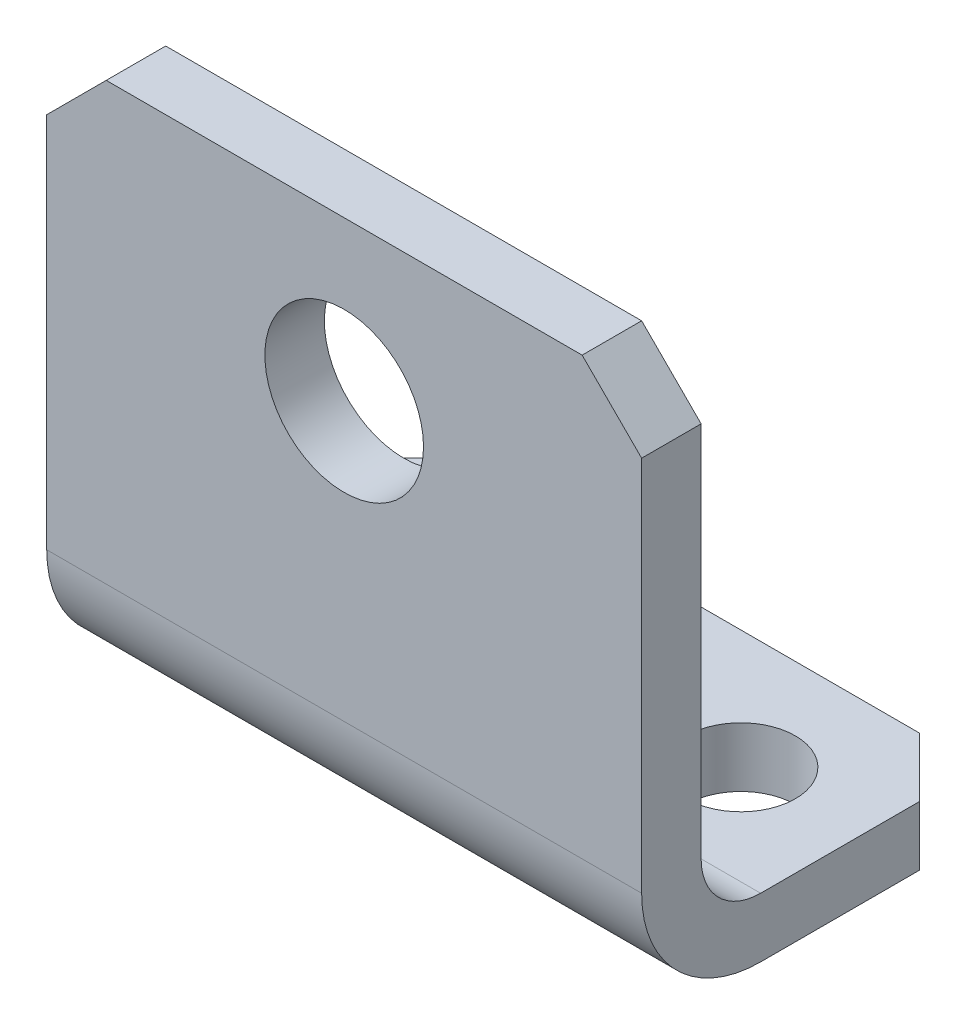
ISO-10303-21;
HEADER;
FILE_DESCRIPTION(('STEP AP214'),'2;1');
FILE_NAME('part.step','',(''),(''),'','','');
FILE_SCHEMA(('AUTOMOTIVE_DESIGN { 1 0 10303 214 1 1 1 1 }'));
ENDSEC;
DATA;
#1=APPLICATION_CONTEXT('core data for automotive mechanical design processes');
#2=APPLICATION_PROTOCOL_DEFINITION('international standard','automotive_design',2000,#1);
#3=PRODUCT_CONTEXT('',#1,'mechanical');
#4=PRODUCT('Part','Part','',(#3));
#5=PRODUCT_RELATED_PRODUCT_CATEGORY('part','',(#4));
#6=PRODUCT_DEFINITION_FORMATION('','',#4);
#7=PRODUCT_DEFINITION_CONTEXT('part definition',#1,'design');
#8=PRODUCT_DEFINITION('design','',#6,#7);
#9=PRODUCT_DEFINITION_SHAPE('','',#8);
#10=(LENGTH_UNIT() NAMED_UNIT(*) SI_UNIT(.MILLI.,.METRE.));
#11=(NAMED_UNIT(*) PLANE_ANGLE_UNIT() SI_UNIT($,.RADIAN.));
#12=(NAMED_UNIT(*) SI_UNIT($,.STERADIAN.) SOLID_ANGLE_UNIT());
#13=UNCERTAINTY_MEASURE_WITH_UNIT(LENGTH_MEASURE(1.E-05),#10,'distance_accuracy_value','');
#14=(GEOMETRIC_REPRESENTATION_CONTEXT(3) GLOBAL_UNCERTAINTY_ASSIGNED_CONTEXT((#13)) GLOBAL_UNIT_ASSIGNED_CONTEXT((#10,
#11,#12)) REPRESENTATION_CONTEXT('',''));
#15=CARTESIAN_POINT('',(0.,0.,0.));
#16=DIRECTION('',(0.,0.,1.));
#17=DIRECTION('',(1.,0.,0.));
#18=AXIS2_PLACEMENT_3D('',#15,#16,#17);
#19=CARTESIAN_POINT('',(29.9999999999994,-22.0000000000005,2.22044604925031E-13));
#20=DIRECTION('',(0.,0.,-1.));
#21=DIRECTION('',(0.,0.999999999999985,0.));
#22=AXIS2_PLACEMENT_3D('',#19,#20,#21);
#23=PLANE('',#22);
#24=CARTESIAN_POINT('',(15.0000000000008,-8.00000000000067,1.11022302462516E-13));
#25=DIRECTION('',(0.,0.,1.));
#26=DIRECTION('',(1.00000000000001,0.,0.));
#27=AXIS2_PLACEMENT_3D('',#24,#25,#26);
#28=CIRCLE('',#27,4.);
#29=CARTESIAN_POINT('',(19.0000000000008,-8.00000000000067,1.0902390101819E-13));
#30=VERTEX_POINT('',#29);
#31=EDGE_CURVE('E161',#30,#30,#28,.T.);
#32=ORIENTED_EDGE('',*,*,#31,.F.);
#33=EDGE_LOOP('',(#32));
#34=FACE_BOUND('',#33,.T.);
#35=DIRECTION('',(-1.00000000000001,0.,0.));
#36=VECTOR('',#35,1.);
#37=CARTESIAN_POINT('',(29.9999999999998,-1.55431223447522E-12,-1.11022302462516E-13));
#38=LINE('',#37,#36);
#39=CARTESIAN_POINT('',(27.0000000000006,0.,2.22044604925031E-13));
#40=VERTEX_POINT('',#39);
#41=CARTESIAN_POINT('',(3.00000000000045,0.,0.));
#42=VERTEX_POINT('',#41);
#43=EDGE_CURVE('E205',#40,#42,#38,.T.);
#44=ORIENTED_EDGE('',*,*,#43,.T.);
#45=DIRECTION('',(0.70710678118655,0.707106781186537,0.));
#46=VECTOR('',#45,1.);
#47=CARTESIAN_POINT('',(3.00000000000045,0.,0.));
#48=LINE('',#47,#46);
#49=CARTESIAN_POINT('',(-1.66533453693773E-12,-2.99999999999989,7.7715611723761E-13));
#50=VERTEX_POINT('',#49);
#51=EDGE_CURVE('E194',#42,#50,#48,.F.);
#52=ORIENTED_EDGE('',*,*,#51,.T.);
#53=DIRECTION('',(0.,-0.999999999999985,0.));
#54=VECTOR('',#53,1.);
#55=CARTESIAN_POINT('',(4.44089209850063E-13,-22.0000000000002,5.55111512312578E-13));
#56=LINE('',#55,#54);
#57=CARTESIAN_POINT('',(4.44089209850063E-13,-22.0000000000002,5.55111512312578E-13));
#58=VERTEX_POINT('',#57);
#59=EDGE_CURVE('E149',#50,#58,#56,.T.);
#60=ORIENTED_EDGE('',*,*,#59,.T.);
#61=DIRECTION('',(-1.00000000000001,0.,0.));
#62=VECTOR('',#61,1.);
#63=CARTESIAN_POINT('',(29.9999999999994,-22.0000000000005,2.22044604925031E-13));
#64=LINE('',#63,#62);
#65=CARTESIAN_POINT('',(29.9999999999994,-22.0000000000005,2.22044604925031E-13));
#66=VERTEX_POINT('',#65);
#67=EDGE_CURVE('E141',#66,#58,#64,.T.);
#68=ORIENTED_EDGE('',*,*,#67,.F.);
#69=DIRECTION('',(0.,-0.999999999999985,0.));
#70=VECTOR('',#69,1.);
#71=CARTESIAN_POINT('',(29.9999999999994,-22.0000000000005,2.22044604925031E-13));
#72=LINE('',#71,#70);
#73=CARTESIAN_POINT('',(29.9999999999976,-3.00000000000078,5.55111512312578E-13));
#74=VERTEX_POINT('',#73);
#75=EDGE_CURVE('E125',#74,#66,#72,.T.);
#76=ORIENTED_EDGE('',*,*,#75,.F.);
#77=DIRECTION('',(-0.707106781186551,0.707106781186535,0.));
#78=VECTOR('',#77,1.);
#79=CARTESIAN_POINT('',(29.9999999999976,-3.00000000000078,5.55111512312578E-13));
#80=LINE('',#79,#78);
#81=EDGE_CURVE('E192',#74,#40,#80,.T.);
#82=ORIENTED_EDGE('',*,*,#81,.T.);
#83=EDGE_LOOP('',(#44,#52,#60,#68,#76,#82));
#84=FACE_BOUND('',#83,.T.);
#85=ADVANCED_FACE('F36',(#34,#84),#23,.F.);
#86=CARTESIAN_POINT('',(30.0000000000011,-22.0000000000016,-5.99999999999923));
#87=DIRECTION('',(-1.00000000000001,0.,0.));
#88=DIRECTION('',(0.,0.,1.));
#89=AXIS2_PLACEMENT_3D('',#86,#87,#88);
#90=CYLINDRICAL_SURFACE('',#89,6.);
#91=CARTESIAN_POINT('',(2.44249065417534E-12,-22.0000000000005,-5.99999999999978));
#92=DIRECTION('',(1.00000000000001,0.,0.));
#93=DIRECTION('',(0.,0.,1.));
#94=AXIS2_PLACEMENT_3D('',#91,#92,#93);
#95=CIRCLE('',#94,6.);
#96=CARTESIAN_POINT('',(1.55431223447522E-12,-28.0000000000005,-6.00000000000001));
#97=VERTEX_POINT('',#96);
#98=EDGE_CURVE('E249',#58,#97,#95,.T.);
#99=ORIENTED_EDGE('',*,*,#98,.T.);
#100=DIRECTION('',(-1.00000000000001,0.,0.));
#101=VECTOR('',#100,1.);
#102=CARTESIAN_POINT('',(30.000000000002,-28.0000000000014,-5.99999999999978));
#103=LINE('',#102,#101);
#104=CARTESIAN_POINT('',(30.000000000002,-28.0000000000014,-5.99999999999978));
#105=VERTEX_POINT('',#104);
#106=EDGE_CURVE('E143',#105,#97,#103,.T.);
#107=ORIENTED_EDGE('',*,*,#106,.F.);
#108=CARTESIAN_POINT('',(30.0000000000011,-22.0000000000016,-5.99999999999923));
#109=DIRECTION('',(1.00000000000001,0.,0.));
#110=DIRECTION('',(0.,0.,1.));
#111=AXIS2_PLACEMENT_3D('',#108,#109,#110);
#112=CIRCLE('',#111,6.);
#113=EDGE_CURVE('E129',#66,#105,#112,.T.);
#114=ORIENTED_EDGE('',*,*,#113,.F.);
#115=ORIENTED_EDGE('',*,*,#67,.T.);
#116=EDGE_LOOP('',(#99,#107,#114,#115));
#117=FACE_BOUND('',#116,.T.);
#118=ADVANCED_FACE('F140',(#117),#90,.T.);
#119=CARTESIAN_POINT('',(30.0000000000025,-28.0000000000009,-16.9999999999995));
#120=DIRECTION('',(0.,0.999999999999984,0.));
#121=DIRECTION('',(0.,0.,1.));
#122=AXIS2_PLACEMENT_3D('',#119,#120,#121);
#123=PLANE('',#122);
#124=CARTESIAN_POINT('',(5.9999999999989,-27.9999999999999,-10.9999999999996));
#125=DIRECTION('',(0.,-0.999999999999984,0.));
#126=DIRECTION('',(0.,0.,-1.));
#127=AXIS2_PLACEMENT_3D('',#124,#125,#126);
#128=CIRCLE('',#127,2.75);
#129=CARTESIAN_POINT('',(6.00000000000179,-27.9999999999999,-13.7499999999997));
#130=VERTEX_POINT('',#129);
#131=EDGE_CURVE('E166',#130,#130,#128,.T.);
#132=ORIENTED_EDGE('',*,*,#131,.F.);
#133=EDGE_LOOP('',(#132));
#134=FACE_BOUND('',#133,.T.);
#135=CARTESIAN_POINT('',(24.0000000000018,-28.,-11.0000000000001));
#136=DIRECTION('',(0.,-0.999999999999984,0.));
#137=DIRECTION('',(0.,0.,-1.));
#138=AXIS2_PLACEMENT_3D('',#135,#136,#137);
#139=CIRCLE('',#138,2.75);
#140=CARTESIAN_POINT('',(24.,-28.,-13.7499999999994));
#141=VERTEX_POINT('',#140);
#142=EDGE_CURVE('E260',#141,#141,#139,.T.);
#143=ORIENTED_EDGE('',*,*,#142,.F.);
#144=EDGE_LOOP('',(#143));
#145=FACE_BOUND('',#144,.T.);
#146=DIRECTION('',(-1.00000000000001,0.,0.));
#147=VECTOR('',#146,1.);
#148=CARTESIAN_POINT('',(30.0000000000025,-28.0000000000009,-16.9999999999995));
#149=LINE('',#148,#147);
#150=CARTESIAN_POINT('',(27.0000000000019,-28.0000000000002,-17.0000000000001));
#151=VERTEX_POINT('',#150);
#152=CARTESIAN_POINT('',(3.000000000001,-28.0000000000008,-16.9999999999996));
#153=VERTEX_POINT('',#152);
#154=EDGE_CURVE('E154',#151,#153,#149,.T.);
#155=ORIENTED_EDGE('',*,*,#154,.F.);
#156=DIRECTION('',(0.707106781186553,0.,0.707106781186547));
#157=VECTOR('',#156,1.);
#158=CARTESIAN_POINT('',(30.000000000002,-28.0000000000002,-14.0000000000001));
#159=LINE('',#158,#157);
#160=CARTESIAN_POINT('',(30.000000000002,-28.0000000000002,-14.0000000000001));
#161=VERTEX_POINT('',#160);
#162=EDGE_CURVE('E182',#151,#161,#159,.T.);
#163=ORIENTED_EDGE('',*,*,#162,.T.);
#164=DIRECTION('',(0.,0.,-1.));
#165=VECTOR('',#164,1.);
#166=CARTESIAN_POINT('',(30.0000000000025,-28.0000000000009,-16.9999999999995));
#167=LINE('',#166,#165);
#168=EDGE_CURVE('E145',#105,#161,#167,.T.);
#169=ORIENTED_EDGE('',*,*,#168,.F.);
#170=ORIENTED_EDGE('',*,*,#106,.T.);
#171=DIRECTION('',(0.,0.,-1.));
#172=VECTOR('',#171,1.);
#173=CARTESIAN_POINT('',(7.7715611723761E-13,-28.0000000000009,-16.9999999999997));
#174=LINE('',#173,#172);
#175=CARTESIAN_POINT('',(1.33226762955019E-12,-28.0000000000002,-13.9999999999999));
#176=VERTEX_POINT('',#175);
#177=EDGE_CURVE('E247',#97,#176,#174,.T.);
#178=ORIENTED_EDGE('',*,*,#177,.T.);
#179=DIRECTION('',(-0.707106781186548,0.,0.70710678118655));
#180=VECTOR('',#179,1.);
#181=CARTESIAN_POINT('',(3.000000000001,-28.0000000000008,-16.9999999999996));
#182=LINE('',#181,#180);
#183=EDGE_CURVE('E180',#176,#153,#182,.F.);
#184=ORIENTED_EDGE('',*,*,#183,.T.);
#185=EDGE_LOOP('',(#155,#163,#169,#170,#178,#184));
#186=FACE_BOUND('',#185,.T.);
#187=ADVANCED_FACE('F269',(#134,#145,#186),#123,.F.);
#188=CARTESIAN_POINT('',(30.0000000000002,-25.0000000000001,-17.0000000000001));
#189=DIRECTION('',(0.,0.,1.));
#190=DIRECTION('',(1.00000000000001,0.,0.));
#191=AXIS2_PLACEMENT_3D('',#188,#189,#190);
#192=PLANE('',#191);
#193=DIRECTION('',(-1.00000000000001,0.,0.));
#194=VECTOR('',#193,1.);
#195=CARTESIAN_POINT('',(30.0000000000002,-25.0000000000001,-17.0000000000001));
#196=LINE('',#195,#194);
#197=CARTESIAN_POINT('',(27.000000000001,-25.0000000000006,-17.));
#198=VERTEX_POINT('',#197);
#199=CARTESIAN_POINT('',(3.00000000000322,-25.0000000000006,-16.9999999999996));
#200=VERTEX_POINT('',#199);
#201=EDGE_CURVE('E219',#198,#200,#196,.T.);
#202=ORIENTED_EDGE('',*,*,#201,.F.);
#203=DIRECTION('',(0.,-0.999999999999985,0.));
#204=VECTOR('',#203,1.);
#205=CARTESIAN_POINT('',(27.0000000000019,-28.0000000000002,-17.0000000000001));
#206=LINE('',#205,#204);
#207=EDGE_CURVE('E178',#198,#151,#206,.T.);
#208=ORIENTED_EDGE('',*,*,#207,.T.);
#209=ORIENTED_EDGE('',*,*,#154,.T.);
#210=DIRECTION('',(0.,0.999999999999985,0.));
#211=VECTOR('',#210,1.);
#212=CARTESIAN_POINT('',(3.00000000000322,-25.0000000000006,-16.9999999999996));
#213=LINE('',#212,#211);
#214=EDGE_CURVE('E175',#153,#200,#213,.T.);
#215=ORIENTED_EDGE('',*,*,#214,.T.);
#216=EDGE_LOOP('',(#202,#208,#209,#215));
#217=FACE_BOUND('',#216,.T.);
#218=ADVANCED_FACE('F226',(#217),#192,.F.);
#219=CARTESIAN_POINT('',(30.0000000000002,-25.000000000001,-5.99999999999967));
#220=DIRECTION('',(0.,-0.999999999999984,0.));
#221=DIRECTION('',(0.,0.,-1.));
#222=AXIS2_PLACEMENT_3D('',#219,#220,#221);
#223=PLANE('',#222);
#224=CARTESIAN_POINT('',(6.00000000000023,-25.0000000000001,-10.9999999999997));
#225=DIRECTION('',(0.,-0.999999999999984,0.));
#226=DIRECTION('',(0.,0.,-1.));
#227=AXIS2_PLACEMENT_3D('',#224,#225,#226);
#228=CIRCLE('',#227,2.75);
#229=CARTESIAN_POINT('',(6.00000000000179,-25.0000000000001,-13.7499999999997));
#230=VERTEX_POINT('',#229);
#231=EDGE_CURVE('E165',#230,#230,#228,.T.);
#232=ORIENTED_EDGE('',*,*,#231,.T.);
#233=EDGE_LOOP('',(#232));
#234=FACE_BOUND('',#233,.T.);
#235=CARTESIAN_POINT('',(23.9999999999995,-25.0000000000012,-10.9999999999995));
#236=DIRECTION('',(0.,-0.999999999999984,0.));
#237=DIRECTION('',(0.,0.,-1.));
#238=AXIS2_PLACEMENT_3D('',#235,#236,#237);
#239=CIRCLE('',#238,2.75);
#240=CARTESIAN_POINT('',(24.,-25.0000000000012,-13.7499999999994));
#241=VERTEX_POINT('',#240);
#242=EDGE_CURVE('E162',#241,#241,#239,.T.);
#243=ORIENTED_EDGE('',*,*,#242,.T.);
#244=EDGE_LOOP('',(#243));
#245=FACE_BOUND('',#244,.T.);
#246=DIRECTION('',(0.,0.,1.));
#247=VECTOR('',#246,1.);
#248=CARTESIAN_POINT('',(30.0000000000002,-25.000000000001,-5.99999999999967));
#249=LINE('',#248,#247);
#250=CARTESIAN_POINT('',(29.9999999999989,-25.000000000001,-14.0000000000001));
#251=VERTEX_POINT('',#250);
#252=CARTESIAN_POINT('',(30.0000000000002,-25.000000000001,-5.99999999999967));
#253=VERTEX_POINT('',#252);
#254=EDGE_CURVE('E255',#251,#253,#249,.T.);
#255=ORIENTED_EDGE('',*,*,#254,.F.);
#256=DIRECTION('',(-0.707106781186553,0.,-0.707106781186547));
#257=VECTOR('',#256,1.);
#258=CARTESIAN_POINT('',(29.9999999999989,-25.000000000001,-14.0000000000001));
#259=LINE('',#258,#257);
#260=EDGE_CURVE('E173',#251,#198,#259,.T.);
#261=ORIENTED_EDGE('',*,*,#260,.T.);
#262=ORIENTED_EDGE('',*,*,#201,.T.);
#263=DIRECTION('',(0.707106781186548,0.,-0.70710678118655));
#264=VECTOR('',#263,1.);
#265=CARTESIAN_POINT('',(3.00000000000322,-25.0000000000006,-16.9999999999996));
#266=LINE('',#265,#264);
#267=CARTESIAN_POINT('',(1.33226762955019E-12,-24.9999999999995,-13.9999999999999));
#268=VERTEX_POINT('',#267);
#269=EDGE_CURVE('E171',#200,#268,#266,.F.);
#270=ORIENTED_EDGE('',*,*,#269,.T.);
#271=DIRECTION('',(0.,0.,1.));
#272=VECTOR('',#271,1.);
#273=CARTESIAN_POINT('',(3.5527136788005E-12,-25.0000000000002,-5.99999999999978));
#274=LINE('',#273,#272);
#275=CARTESIAN_POINT('',(3.5527136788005E-12,-25.0000000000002,-5.99999999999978));
#276=VERTEX_POINT('',#275);
#277=EDGE_CURVE('E239',#268,#276,#274,.T.);
#278=ORIENTED_EDGE('',*,*,#277,.T.);
#279=DIRECTION('',(-1.00000000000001,0.,0.));
#280=VECTOR('',#279,1.);
#281=CARTESIAN_POINT('',(30.0000000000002,-25.000000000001,-5.99999999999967));
#282=LINE('',#281,#280);
#283=EDGE_CURVE('E216',#253,#276,#282,.T.);
#284=ORIENTED_EDGE('',*,*,#283,.F.);
#285=EDGE_LOOP('',(#255,#261,#262,#270,#278,#284));
#286=FACE_BOUND('',#285,.T.);
#287=ADVANCED_FACE('F237',(#234,#245,#286),#223,.F.);
#288=CARTESIAN_POINT('',(30.0000000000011,-22.0000000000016,-5.99999999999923));
#289=DIRECTION('',(-1.00000000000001,0.,0.));
#290=DIRECTION('',(0.,0.,1.));
#291=AXIS2_PLACEMENT_3D('',#288,#289,#290);
#292=CYLINDRICAL_SURFACE('',#291,3.);
#293=CARTESIAN_POINT('',(2.44249065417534E-12,-22.0000000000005,-5.99999999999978));
#294=DIRECTION('',(-1.00000000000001,0.,0.));
#295=DIRECTION('',(0.,0.,-1.));
#296=AXIS2_PLACEMENT_3D('',#293,#294,#295);
#297=CIRCLE('',#296,3.);
#298=CARTESIAN_POINT('',(2.22044604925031E-13,-22.,-3.00000000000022));
#299=VERTEX_POINT('',#298);
#300=EDGE_CURVE('E246',#276,#299,#297,.T.);
#301=ORIENTED_EDGE('',*,*,#300,.T.);
#302=DIRECTION('',(-1.00000000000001,0.,0.));
#303=VECTOR('',#302,1.);
#304=CARTESIAN_POINT('',(29.9999999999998,-21.9999999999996,-2.99999999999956));
#305=LINE('',#304,#303);
#306=CARTESIAN_POINT('',(29.9999999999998,-21.9999999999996,-2.99999999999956));
#307=VERTEX_POINT('',#306);
#308=EDGE_CURVE('E210',#307,#299,#305,.T.);
#309=ORIENTED_EDGE('',*,*,#308,.F.);
#310=CARTESIAN_POINT('',(30.0000000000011,-22.0000000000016,-5.99999999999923));
#311=DIRECTION('',(-1.00000000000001,0.,0.));
#312=DIRECTION('',(0.,0.,-1.));
#313=AXIS2_PLACEMENT_3D('',#310,#311,#312);
#314=CIRCLE('',#313,3.);
#315=EDGE_CURVE('E203',#253,#307,#314,.T.);
#316=ORIENTED_EDGE('',*,*,#315,.F.);
#317=ORIENTED_EDGE('',*,*,#283,.T.);
#318=EDGE_LOOP('',(#301,#309,#316,#317));
#319=FACE_BOUND('',#318,.T.);
#320=ADVANCED_FACE('F283',(#319),#292,.F.);
#321=CARTESIAN_POINT('',(30.0000000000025,2.22044604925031E-13,-2.99999999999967));
#322=DIRECTION('',(0.,0.,1.));
#323=DIRECTION('',(0.,-0.999999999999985,0.));
#324=AXIS2_PLACEMENT_3D('',#321,#322,#323);
#325=PLANE('',#324);
#326=CARTESIAN_POINT('',(15.0000000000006,-8.00000000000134,-3.00000000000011));
#327=DIRECTION('',(0.,0.,1.));
#328=DIRECTION('',(0.,-0.999999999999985,0.));
#329=AXIS2_PLACEMENT_3D('',#326,#327,#328);
#330=CIRCLE('',#329,4.);
#331=CARTESIAN_POINT('',(15.0000000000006,-12.0000000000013,-3.00000000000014));
#332=VERTEX_POINT('',#331);
#333=EDGE_CURVE('E158',#332,#332,#330,.T.);
#334=ORIENTED_EDGE('',*,*,#333,.T.);
#335=EDGE_LOOP('',(#334));
#336=FACE_BOUND('',#335,.T.);
#337=DIRECTION('',(0.,0.999999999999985,0.));
#338=VECTOR('',#337,1.);
#339=CARTESIAN_POINT('',(-1.99840144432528E-12,2.22044604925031E-13,-3.00000000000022));
#340=LINE('',#339,#338);
#341=CARTESIAN_POINT('',(6.66133814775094E-13,-3.00000000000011,-3.00000000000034));
#342=VERTEX_POINT('',#341);
#343=EDGE_CURVE('E136',#299,#342,#340,.T.);
#344=ORIENTED_EDGE('',*,*,#343,.T.);
#345=DIRECTION('',(-0.70710678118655,-0.707106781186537,0.));
#346=VECTOR('',#345,1.);
#347=CARTESIAN_POINT('',(2.99999999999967,-8.88178419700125E-13,-2.99999999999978));
#348=LINE('',#347,#346);
#349=CARTESIAN_POINT('',(2.99999999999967,-8.88178419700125E-13,-2.99999999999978));
#350=VERTEX_POINT('',#349);
#351=EDGE_CURVE('E11',#342,#350,#348,.F.);
#352=ORIENTED_EDGE('',*,*,#351,.T.);
#353=DIRECTION('',(-1.00000000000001,0.,0.));
#354=VECTOR('',#353,1.);
#355=CARTESIAN_POINT('',(30.0000000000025,2.22044604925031E-13,-2.99999999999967));
#356=LINE('',#355,#354);
#357=CARTESIAN_POINT('',(27.0000000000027,0.,-2.99999999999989));
#358=VERTEX_POINT('',#357);
#359=EDGE_CURVE('E200',#358,#350,#356,.T.);
#360=ORIENTED_EDGE('',*,*,#359,.F.);
#361=DIRECTION('',(0.707106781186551,-0.707106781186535,0.));
#362=VECTOR('',#361,1.);
#363=CARTESIAN_POINT('',(29.9999999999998,-3.00000000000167,-2.99999999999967));
#364=LINE('',#363,#362);
#365=CARTESIAN_POINT('',(29.9999999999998,-3.00000000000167,-2.99999999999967));
#366=VERTEX_POINT('',#365);
#367=EDGE_CURVE('E44',#358,#366,#364,.T.);
#368=ORIENTED_EDGE('',*,*,#367,.T.);
#369=DIRECTION('',(0.,0.999999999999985,0.));
#370=VECTOR('',#369,1.);
#371=CARTESIAN_POINT('',(30.0000000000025,2.22044604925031E-13,-2.99999999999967));
#372=LINE('',#371,#370);
#373=EDGE_CURVE('E199',#307,#366,#372,.T.);
#374=ORIENTED_EDGE('',*,*,#373,.F.);
#375=ORIENTED_EDGE('',*,*,#308,.T.);
#376=EDGE_LOOP('',(#344,#352,#360,#368,#374,#375));
#377=FACE_BOUND('',#376,.T.);
#378=ADVANCED_FACE('F197',(#336,#377),#325,.F.);
#379=CARTESIAN_POINT('',(29.9999999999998,-1.55431223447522E-12,-1.11022302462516E-13));
#380=DIRECTION('',(0.,-0.999999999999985,0.));
#381=DIRECTION('',(0.,0.,-1.));
#382=AXIS2_PLACEMENT_3D('',#379,#380,#381);
#383=PLANE('',#382);
#384=ORIENTED_EDGE('',*,*,#359,.T.);
#385=DIRECTION('',(0.,0.,1.));
#386=VECTOR('',#385,1.);
#387=CARTESIAN_POINT('',(3.00000000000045,0.,0.));
#388=LINE('',#387,#386);
#389=EDGE_CURVE('E189',#350,#42,#388,.T.);
#390=ORIENTED_EDGE('',*,*,#389,.T.);
#391=ORIENTED_EDGE('',*,*,#43,.F.);
#392=DIRECTION('',(0.,0.,-1.));
#393=VECTOR('',#392,1.);
#394=CARTESIAN_POINT('',(27.0000000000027,0.,-2.99999999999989));
#395=LINE('',#394,#393);
#396=EDGE_CURVE('E56',#40,#358,#395,.T.);
#397=ORIENTED_EDGE('',*,*,#396,.T.);
#398=EDGE_LOOP('',(#384,#390,#391,#397));
#399=FACE_BOUND('',#398,.T.);
#400=ADVANCED_FACE('F207',(#399),#383,.F.);
#401=CARTESIAN_POINT('',(30.0000000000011,-22.0000000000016,-5.99999999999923));
#402=DIRECTION('',(1.00000000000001,0.,0.));
#403=DIRECTION('',(0.,0.,-1.));
#404=AXIS2_PLACEMENT_3D('',#401,#402,#403);
#405=PLANE('',#404);
#406=ORIENTED_EDGE('',*,*,#168,.T.);
#407=DIRECTION('',(0.,0.999999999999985,0.));
#408=VECTOR('',#407,1.);
#409=CARTESIAN_POINT('',(29.9999999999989,-25.000000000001,-14.0000000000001));
#410=LINE('',#409,#408);
#411=EDGE_CURVE('E152',#161,#251,#410,.T.);
#412=ORIENTED_EDGE('',*,*,#411,.T.);
#413=ORIENTED_EDGE('',*,*,#254,.T.);
#414=ORIENTED_EDGE('',*,*,#315,.T.);
#415=ORIENTED_EDGE('',*,*,#373,.T.);
#416=DIRECTION('',(0.,0.,1.));
#417=VECTOR('',#416,1.);
#418=CARTESIAN_POINT('',(29.9999999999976,-3.00000000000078,5.55111512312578E-13));
#419=LINE('',#418,#417);
#420=EDGE_CURVE('E133',#366,#74,#419,.T.);
#421=ORIENTED_EDGE('',*,*,#420,.T.);
#422=ORIENTED_EDGE('',*,*,#75,.T.);
#423=ORIENTED_EDGE('',*,*,#113,.T.);
#424=EDGE_LOOP('',(#406,#412,#413,#414,#415,#421,#422,#423));
#425=FACE_BOUND('',#424,.T.);
#426=ADVANCED_FACE('F128',(#425),#405,.T.);
#427=CARTESIAN_POINT('',(2.44249065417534E-12,-22.0000000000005,-5.99999999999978));
#428=DIRECTION('',(1.00000000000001,0.,0.));
#429=DIRECTION('',(0.,0.,-1.));
#430=AXIS2_PLACEMENT_3D('',#427,#428,#429);
#431=PLANE('',#430);
#432=ORIENTED_EDGE('',*,*,#277,.F.);
#433=DIRECTION('',(0.,-0.999999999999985,0.));
#434=VECTOR('',#433,1.);
#435=CARTESIAN_POINT('',(1.55431223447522E-12,-22.0000000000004,-13.9999999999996));
#436=LINE('',#435,#434);
#437=EDGE_CURVE('E186',#268,#176,#436,.T.);
#438=ORIENTED_EDGE('',*,*,#437,.T.);
#439=ORIENTED_EDGE('',*,*,#177,.F.);
#440=ORIENTED_EDGE('',*,*,#98,.F.);
#441=ORIENTED_EDGE('',*,*,#59,.F.);
#442=DIRECTION('',(0.,0.,-1.));
#443=VECTOR('',#442,1.);
#444=CARTESIAN_POINT('',(3.77475828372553E-12,-3.00000000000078,-6.00000000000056));
#445=LINE('',#444,#443);
#446=EDGE_CURVE('E184',#50,#342,#445,.T.);
#447=ORIENTED_EDGE('',*,*,#446,.T.);
#448=ORIENTED_EDGE('',*,*,#343,.F.);
#449=ORIENTED_EDGE('',*,*,#300,.F.);
#450=EDGE_LOOP('',(#432,#438,#439,#440,#441,#447,#448,#449));
#451=FACE_BOUND('',#450,.T.);
#452=ADVANCED_FACE('F242',(#451),#431,.F.);
#453=CARTESIAN_POINT('',(15.0000000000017,-8.00000000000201,-9.99999999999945));
#454=DIRECTION('',(0.,0.,1.));
#455=DIRECTION('',(1.00000000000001,0.,0.));
#456=AXIS2_PLACEMENT_3D('',#453,#454,#455);
#457=CYLINDRICAL_SURFACE('',#456,4.);
#458=ORIENTED_EDGE('',*,*,#31,.T.);
#459=EDGE_LOOP('',(#458));
#460=FACE_BOUND('',#459,.T.);
#461=ORIENTED_EDGE('',*,*,#333,.F.);
#462=EDGE_LOOP('',(#461));
#463=FACE_BOUND('',#462,.T.);
#464=ADVANCED_FACE('F278',(#460,#463),#457,.F.);
#465=CARTESIAN_POINT('',(24.,-18.0000000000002,-10.9999999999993));
#466=DIRECTION('',(0.,-0.999999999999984,0.));
#467=DIRECTION('',(0.,0.,-1.));
#468=AXIS2_PLACEMENT_3D('',#465,#466,#467);
#469=CYLINDRICAL_SURFACE('',#468,2.75);
#470=CARTESIAN_POINT('',(24.,-28.,-13.7499999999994));
#471=CARTESIAN_POINT('',(24.,-27.96875,-13.7499999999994));
#472=CARTESIAN_POINT('',(24.,-27.9375,-13.7499999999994));
#473=CARTESIAN_POINT('',(24.,-27.8750000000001,-13.7499999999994));
#474=CARTESIAN_POINT('',(24.,-27.8437500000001,-13.7499999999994));
#475=CARTESIAN_POINT('',(24.,-27.7812500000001,-13.7499999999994));
#476=CARTESIAN_POINT('',(24.,-27.7500000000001,-13.7499999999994));
#477=CARTESIAN_POINT('',(24.,-27.6875000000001,-13.7499999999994));
#478=CARTESIAN_POINT('',(24.,-27.6562500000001,-13.7499999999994));
#479=CARTESIAN_POINT('',(24.,-27.5937500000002,-13.7499999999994));
#480=CARTESIAN_POINT('',(24.,-27.5625000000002,-13.7499999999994));
#481=CARTESIAN_POINT('',(24.,-27.5000000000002,-13.7499999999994));
#482=CARTESIAN_POINT('',(24.,-27.4687500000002,-13.7499999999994));
#483=CARTESIAN_POINT('',(24.,-27.4062500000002,-13.7499999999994));
#484=CARTESIAN_POINT('',(24.,-27.3750000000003,-13.7499999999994));
#485=CARTESIAN_POINT('',(24.,-27.3125000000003,-13.7499999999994));
#486=CARTESIAN_POINT('',(24.,-27.2812500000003,-13.7499999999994));
#487=CARTESIAN_POINT('',(24.,-27.2187500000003,-13.7499999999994));
#488=CARTESIAN_POINT('',(24.,-27.1875000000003,-13.7499999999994));
#489=CARTESIAN_POINT('',(24.,-27.1250000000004,-13.7499999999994));
#490=CARTESIAN_POINT('',(24.,-27.0937500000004,-13.7499999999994));
#491=CARTESIAN_POINT('',(24.,-27.0312500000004,-13.7499999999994));
#492=CARTESIAN_POINT('',(24.,-27.0000000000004,-13.7499999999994));
#493=CARTESIAN_POINT('',(24.,-26.9375000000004,-13.7499999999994));
#494=CARTESIAN_POINT('',(24.,-26.9062500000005,-13.7499999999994));
#495=CARTESIAN_POINT('',(24.,-26.8437500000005,-13.7499999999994));
#496=CARTESIAN_POINT('',(24.,-26.8125000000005,-13.7499999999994));
#497=CARTESIAN_POINT('',(24.,-26.7500000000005,-13.7499999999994));
#498=CARTESIAN_POINT('',(24.,-26.7187500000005,-13.7499999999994));
#499=CARTESIAN_POINT('',(24.,-26.6562500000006,-13.7499999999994));
#500=CARTESIAN_POINT('',(24.,-26.6250000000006,-13.7499999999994));
#501=CARTESIAN_POINT('',(24.,-26.5625000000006,-13.7499999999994));
#502=CARTESIAN_POINT('',(24.,-26.5312500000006,-13.7499999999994));
#503=CARTESIAN_POINT('',(24.,-26.4687500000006,-13.7499999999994));
#504=CARTESIAN_POINT('',(24.,-26.4375000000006,-13.7499999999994));
#505=CARTESIAN_POINT('',(24.,-26.3750000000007,-13.7499999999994));
#506=CARTESIAN_POINT('',(24.,-26.3437500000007,-13.7499999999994));
#507=CARTESIAN_POINT('',(24.,-26.2812500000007,-13.7499999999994));
#508=CARTESIAN_POINT('',(24.,-26.2500000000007,-13.7499999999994));
#509=CARTESIAN_POINT('',(24.,-26.1875000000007,-13.7499999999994));
#510=CARTESIAN_POINT('',(24.,-26.1562500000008,-13.7499999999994));
#511=CARTESIAN_POINT('',(24.,-26.0937500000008,-13.7499999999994));
#512=CARTESIAN_POINT('',(24.,-26.0625000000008,-13.7499999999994));
#513=CARTESIAN_POINT('',(24.,-26.0000000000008,-13.7499999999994));
#514=CARTESIAN_POINT('',(24.,-25.9687500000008,-13.7499999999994));
#515=CARTESIAN_POINT('',(24.,-25.9062500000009,-13.7499999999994));
#516=CARTESIAN_POINT('',(24.,-25.8750000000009,-13.7499999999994));
#517=CARTESIAN_POINT('',(24.,-25.8125000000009,-13.7499999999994));
#518=CARTESIAN_POINT('',(24.,-25.7812500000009,-13.7499999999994));
#519=CARTESIAN_POINT('',(24.,-25.7187500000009,-13.7499999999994));
#520=CARTESIAN_POINT('',(24.,-25.6875000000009,-13.7499999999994));
#521=CARTESIAN_POINT('',(24.,-25.625000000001,-13.7499999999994));
#522=CARTESIAN_POINT('',(24.,-25.593750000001,-13.7499999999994));
#523=CARTESIAN_POINT('',(24.,-25.531250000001,-13.7499999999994));
#524=CARTESIAN_POINT('',(24.,-25.500000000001,-13.7499999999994));
#525=CARTESIAN_POINT('',(24.,-25.437500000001,-13.7499999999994));
#526=CARTESIAN_POINT('',(24.,-25.4062500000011,-13.7499999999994));
#527=CARTESIAN_POINT('',(24.,-25.3437500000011,-13.7499999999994));
#528=CARTESIAN_POINT('',(24.,-25.3125000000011,-13.7499999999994));
#529=CARTESIAN_POINT('',(24.,-25.2500000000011,-13.7499999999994));
#530=CARTESIAN_POINT('',(24.,-25.2187500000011,-13.7499999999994));
#531=CARTESIAN_POINT('',(24.,-25.1562500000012,-13.7499999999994));
#532=CARTESIAN_POINT('',(24.,-25.1250000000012,-13.7499999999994));
#533=CARTESIAN_POINT('',(24.,-25.0625000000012,-13.7499999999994));
#534=CARTESIAN_POINT('',(24.,-25.0312500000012,-13.7499999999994));
#535=CARTESIAN_POINT('',(24.,-25.0000000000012,-13.7499999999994));
#536=B_SPLINE_CURVE_WITH_KNOTS('',3,(#470,#471,#472,#473,#474,#475,#476,#477,#478,#479,#480,
#481,#482,#483,#484,#485,#486,#487,#488,#489,#490,#491,#492,#493,#494,#495,#496,#497,#498,#499,
#500,#501,#502,#503,#504,#505,#506,#507,#508,#509,#510,#511,#512,#513,#514,#515,#516,#517,#518,
#519,#520,#521,#522,#523,#524,#525,#526,#527,#528,#529,#530,#531,#532,#533,#534,#535),
.UNSPECIFIED.,.F.,.F.,(4,2,2,2,2,2,2,2,2,2,2,2,2,2,2,2,2,2,2,2,2,2,2,2,2,2,2,2,2,2,2,2,4),(0.,
0.0937499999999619,0.187499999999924,0.281249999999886,0.374999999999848,0.468749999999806,
0.562499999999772,0.656249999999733,0.749999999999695,0.843749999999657,0.937499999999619,
1.03124999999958,1.12499999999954,1.2187499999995,1.31249999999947,1.40624999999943,
1.49999999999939,1.59374999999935,1.68749999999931,1.78124999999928,1.87499999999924,
1.9687499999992,2.06249999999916,2.15624999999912,2.24999999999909,2.34374999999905,
2.43749999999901,2.53124999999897,2.62499999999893,2.7187499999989,2.81249999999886,
2.90624999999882,2.99999999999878),.UNSPECIFIED.);
#537=EDGE_CURVE('BSEAM275',#141,#241,#536,.T.);
#538=ORIENTED_EDGE('',*,*,#142,.T.);
#539=ORIENTED_EDGE('',*,*,#242,.F.);
#540=ORIENTED_EDGE('',*,*,#537,.T.);
#541=ORIENTED_EDGE('',*,*,#537,.F.);
#542=EDGE_LOOP('',(#538,#540,#539,#541));
#543=FACE_BOUND('',#542,.T.);
#544=ADVANCED_FACE('F275',(#543),#469,.F.);
#545=CARTESIAN_POINT('',(6.00000000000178,-18.,-10.9999999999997));
#546=DIRECTION('',(0.,-0.999999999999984,0.));
#547=DIRECTION('',(0.,0.,-1.));
#548=AXIS2_PLACEMENT_3D('',#545,#546,#547);
#549=CYLINDRICAL_SURFACE('',#548,2.75);
#550=CARTESIAN_POINT('',(6.00000000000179,-27.9999999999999,-13.7499999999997));
#551=CARTESIAN_POINT('',(6.00000000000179,-27.9687499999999,-13.7499999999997));
#552=CARTESIAN_POINT('',(6.00000000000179,-27.9374999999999,-13.7499999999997));
#553=CARTESIAN_POINT('',(6.00000000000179,-27.8749999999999,-13.7499999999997));
#554=CARTESIAN_POINT('',(6.00000000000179,-27.8437499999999,-13.7499999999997));
#555=CARTESIAN_POINT('',(6.00000000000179,-27.7812499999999,-13.7499999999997));
#556=CARTESIAN_POINT('',(6.00000000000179,-27.7499999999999,-13.7499999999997));
#557=CARTESIAN_POINT('',(6.00000000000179,-27.6874999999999,-13.7499999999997));
#558=CARTESIAN_POINT('',(6.00000000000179,-27.6562499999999,-13.7499999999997));
#559=CARTESIAN_POINT('',(6.00000000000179,-27.5937499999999,-13.7499999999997));
#560=CARTESIAN_POINT('',(6.00000000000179,-27.5624999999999,-13.7499999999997));
#561=CARTESIAN_POINT('',(6.00000000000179,-27.4999999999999,-13.7499999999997));
#562=CARTESIAN_POINT('',(6.00000000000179,-27.4687499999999,-13.7499999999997));
#563=CARTESIAN_POINT('',(6.00000000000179,-27.4062499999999,-13.7499999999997));
#564=CARTESIAN_POINT('',(6.00000000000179,-27.3749999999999,-13.7499999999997));
#565=CARTESIAN_POINT('',(6.00000000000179,-27.3124999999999,-13.7499999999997));
#566=CARTESIAN_POINT('',(6.00000000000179,-27.2812499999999,-13.7499999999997));
#567=CARTESIAN_POINT('',(6.00000000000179,-27.21875,-13.7499999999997));
#568=CARTESIAN_POINT('',(6.00000000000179,-27.1875,-13.7499999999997));
#569=CARTESIAN_POINT('',(6.00000000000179,-27.125,-13.7499999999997));
#570=CARTESIAN_POINT('',(6.00000000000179,-27.09375,-13.7499999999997));
#571=CARTESIAN_POINT('',(6.00000000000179,-27.03125,-13.7499999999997));
#572=CARTESIAN_POINT('',(6.00000000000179,-27.,-13.7499999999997));
#573=CARTESIAN_POINT('',(6.00000000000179,-26.9375,-13.7499999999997));
#574=CARTESIAN_POINT('',(6.00000000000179,-26.90625,-13.7499999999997));
#575=CARTESIAN_POINT('',(6.00000000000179,-26.84375,-13.7499999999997));
#576=CARTESIAN_POINT('',(6.00000000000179,-26.8125,-13.7499999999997));
#577=CARTESIAN_POINT('',(6.00000000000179,-26.75,-13.7499999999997));
#578=CARTESIAN_POINT('',(6.00000000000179,-26.71875,-13.7499999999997));
#579=CARTESIAN_POINT('',(6.00000000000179,-26.65625,-13.7499999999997));
#580=CARTESIAN_POINT('',(6.00000000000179,-26.625,-13.7499999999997));
#581=CARTESIAN_POINT('',(6.00000000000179,-26.5625,-13.7499999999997));
#582=CARTESIAN_POINT('',(6.00000000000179,-26.53125,-13.7499999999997));
#583=CARTESIAN_POINT('',(6.00000000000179,-26.46875,-13.7499999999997));
#584=CARTESIAN_POINT('',(6.00000000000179,-26.4375,-13.7499999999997));
#585=CARTESIAN_POINT('',(6.00000000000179,-26.375,-13.7499999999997));
#586=CARTESIAN_POINT('',(6.00000000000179,-26.34375,-13.7499999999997));
#587=CARTESIAN_POINT('',(6.00000000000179,-26.28125,-13.7499999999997));
#588=CARTESIAN_POINT('',(6.00000000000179,-26.25,-13.7499999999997));
#589=CARTESIAN_POINT('',(6.00000000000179,-26.1875,-13.7499999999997));
#590=CARTESIAN_POINT('',(6.00000000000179,-26.15625,-13.7499999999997));
#591=CARTESIAN_POINT('',(6.00000000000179,-26.09375,-13.7499999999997));
#592=CARTESIAN_POINT('',(6.00000000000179,-26.0625,-13.7499999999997));
#593=CARTESIAN_POINT('',(6.00000000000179,-26.,-13.7499999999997));
#594=CARTESIAN_POINT('',(6.00000000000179,-25.96875,-13.7499999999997));
#595=CARTESIAN_POINT('',(6.00000000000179,-25.90625,-13.7499999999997));
#596=CARTESIAN_POINT('',(6.00000000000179,-25.875,-13.7499999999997));
#597=CARTESIAN_POINT('',(6.00000000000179,-25.8125000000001,-13.7499999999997));
#598=CARTESIAN_POINT('',(6.00000000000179,-25.7812500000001,-13.7499999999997));
#599=CARTESIAN_POINT('',(6.00000000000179,-25.7187500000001,-13.7499999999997));
#600=CARTESIAN_POINT('',(6.00000000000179,-25.6875000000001,-13.7499999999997));
#601=CARTESIAN_POINT('',(6.00000000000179,-25.6250000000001,-13.7499999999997));
#602=CARTESIAN_POINT('',(6.00000000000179,-25.5937500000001,-13.7499999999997));
#603=CARTESIAN_POINT('',(6.00000000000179,-25.5312500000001,-13.7499999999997));
#604=CARTESIAN_POINT('',(6.00000000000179,-25.5000000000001,-13.7499999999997));
#605=CARTESIAN_POINT('',(6.00000000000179,-25.4375000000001,-13.7499999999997));
#606=CARTESIAN_POINT('',(6.00000000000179,-25.4062500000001,-13.7499999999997));
#607=CARTESIAN_POINT('',(6.00000000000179,-25.3437500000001,-13.7499999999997));
#608=CARTESIAN_POINT('',(6.00000000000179,-25.3125000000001,-13.7499999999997));
#609=CARTESIAN_POINT('',(6.00000000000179,-25.2500000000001,-13.7499999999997));
#610=CARTESIAN_POINT('',(6.00000000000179,-25.2187500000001,-13.7499999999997));
#611=CARTESIAN_POINT('',(6.00000000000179,-25.1562500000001,-13.7499999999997));
#612=CARTESIAN_POINT('',(6.00000000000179,-25.1250000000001,-13.7499999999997));
#613=CARTESIAN_POINT('',(6.00000000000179,-25.0625000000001,-13.7499999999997));
#614=CARTESIAN_POINT('',(6.00000000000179,-25.0312500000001,-13.7499999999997));
#615=CARTESIAN_POINT('',(6.00000000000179,-25.0000000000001,-13.7499999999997));
#616=B_SPLINE_CURVE_WITH_KNOTS('',3,(#550,#551,#552,#553,#554,#555,#556,#557,#558,#559,#560,
#561,#562,#563,#564,#565,#566,#567,#568,#569,#570,#571,#572,#573,#574,#575,#576,#577,#578,#579,
#580,#581,#582,#583,#584,#585,#586,#587,#588,#589,#590,#591,#592,#593,#594,#595,#596,#597,#598,
#599,#600,#601,#602,#603,#604,#605,#606,#607,#608,#609,#610,#611,#612,#613,#614,#615),
.UNSPECIFIED.,.F.,.F.,(4,2,2,2,2,2,2,2,2,2,2,2,2,2,2,2,2,2,2,2,2,2,2,2,2,2,2,2,2,2,2,2,4),(0.,
0.0937499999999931,0.187499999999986,0.281249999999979,0.374999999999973,0.468749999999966,
0.562499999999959,0.656249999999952,0.749999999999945,0.843749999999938,0.937499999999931,
1.03124999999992,1.12499999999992,1.21874999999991,1.3124999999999,1.4062499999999,
1.49999999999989,1.59374999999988,1.68749999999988,1.78124999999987,1.87499999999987,
1.96874999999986,2.06249999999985,2.15624999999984,2.24999999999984,2.34374999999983,
2.43749999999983,2.53124999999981,2.62499999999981,2.7187499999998,2.81249999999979,
2.90624999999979,2.99999999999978),.UNSPECIFIED.);
#617=EDGE_CURVE('BSEAM266',#130,#230,#616,.T.);
#618=ORIENTED_EDGE('',*,*,#131,.T.);
#619=ORIENTED_EDGE('',*,*,#231,.F.);
#620=ORIENTED_EDGE('',*,*,#617,.T.);
#621=ORIENTED_EDGE('',*,*,#617,.F.);
#622=EDGE_LOOP('',(#618,#620,#619,#621));
#623=FACE_BOUND('',#622,.T.);
#624=ADVANCED_FACE('F266',(#623),#549,.F.);
#625=CARTESIAN_POINT('',(29.9999999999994,-22.0000000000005,-13.9999999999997));
#626=DIRECTION('',(0.707106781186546,0.,-0.70710678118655));
#627=DIRECTION('',(0.,-0.999999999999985,0.));
#628=AXIS2_PLACEMENT_3D('',#625,#626,#627);
#629=PLANE('',#628);
#630=ORIENTED_EDGE('',*,*,#162,.F.);
#631=ORIENTED_EDGE('',*,*,#207,.F.);
#632=ORIENTED_EDGE('',*,*,#260,.F.);
#633=ORIENTED_EDGE('',*,*,#411,.F.);
#634=EDGE_LOOP('',(#630,#631,#632,#633));
#635=FACE_BOUND('',#634,.T.);
#636=ADVANCED_FACE('F302',(#635),#629,.T.);
#637=CARTESIAN_POINT('',(3.00000000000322,-25.0000000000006,-16.9999999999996));
#638=DIRECTION('',(0.70710678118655,0.,0.707106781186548));
#639=DIRECTION('',(0.,0.999999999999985,0.));
#640=AXIS2_PLACEMENT_3D('',#637,#638,#639);
#641=PLANE('',#640);
#642=ORIENTED_EDGE('',*,*,#183,.F.);
#643=ORIENTED_EDGE('',*,*,#437,.F.);
#644=ORIENTED_EDGE('',*,*,#269,.F.);
#645=ORIENTED_EDGE('',*,*,#214,.F.);
#646=EDGE_LOOP('',(#642,#643,#644,#645));
#647=FACE_BOUND('',#646,.T.);
#648=ADVANCED_FACE('F232',(#647),#641,.F.);
#649=CARTESIAN_POINT('',(3.00000000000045,0.,0.));
#650=DIRECTION('',(0.707106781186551,-0.707106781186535,0.));
#651=DIRECTION('',(0.,0.,1.));
#652=AXIS2_PLACEMENT_3D('',#649,#650,#651);
#653=PLANE('',#652);
#654=ORIENTED_EDGE('',*,*,#351,.F.);
#655=ORIENTED_EDGE('',*,*,#446,.F.);
#656=ORIENTED_EDGE('',*,*,#51,.F.);
#657=ORIENTED_EDGE('',*,*,#389,.F.);
#658=EDGE_LOOP('',(#654,#655,#656,#657));
#659=FACE_BOUND('',#658,.T.);
#660=ADVANCED_FACE('F307',(#659),#653,.F.);
#661=CARTESIAN_POINT('',(30.0000000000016,-3.000000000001,-6.00000000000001));
#662=DIRECTION('',(0.70710678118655,0.707106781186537,0.));
#663=DIRECTION('',(0.,0.,-1.));
#664=AXIS2_PLACEMENT_3D('',#661,#662,#663);
#665=PLANE('',#664);
#666=ORIENTED_EDGE('',*,*,#367,.F.);
#667=ORIENTED_EDGE('',*,*,#396,.F.);
#668=ORIENTED_EDGE('',*,*,#81,.F.);
#669=ORIENTED_EDGE('',*,*,#420,.F.);
#670=EDGE_LOOP('',(#666,#667,#668,#669));
#671=FACE_BOUND('',#670,.T.);
#672=ADVANCED_FACE('F38',(#671),#665,.T.);
#673=CLOSED_SHELL('',(#85,#118,#187,#218,#287,#320,#378,#400,#426,#452,#464,#544,#624,#636,#648,
#660,#672));
#674=MANIFOLD_SOLID_BREP('B2',#673);
#675=ADVANCED_BREP_SHAPE_REPRESENTATION('',(#18,#674),#14);
#676=SHAPE_DEFINITION_REPRESENTATION(#9,#675);
ENDSEC;
END-ISO-10303-21;
